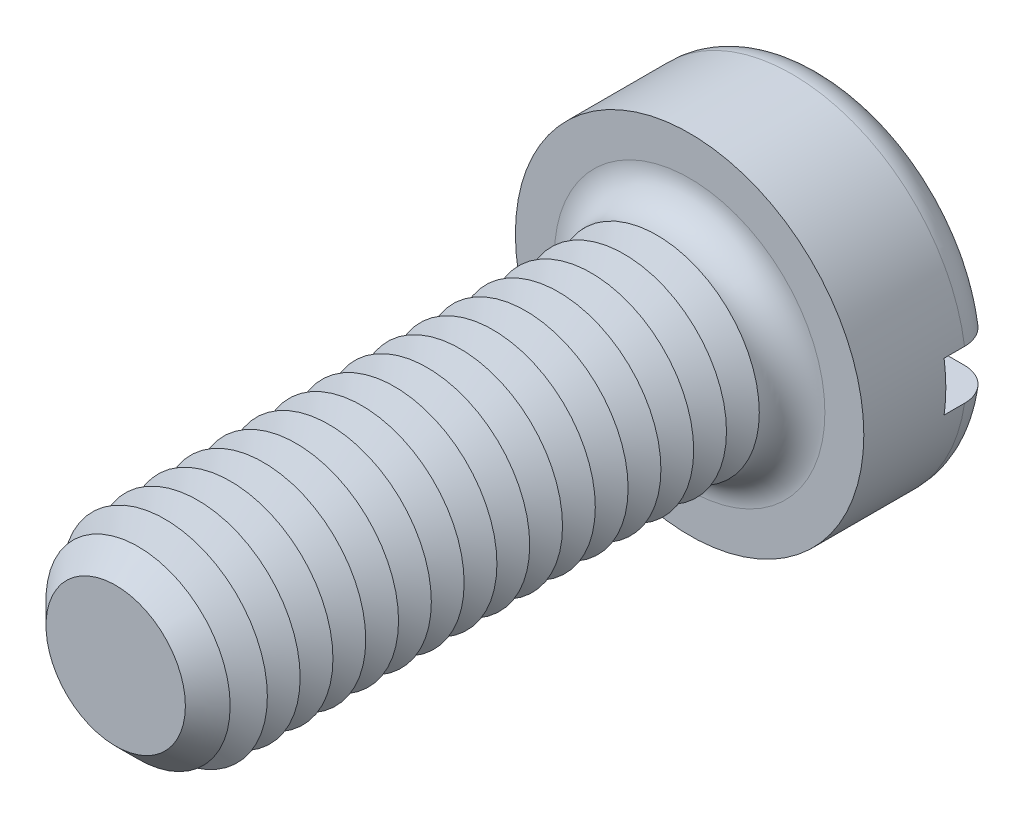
from build123d import *

# Parameters (mm, degrees)
SKETCH3_R           = 4.25
BOSS_EXTRUDE2_DEPTH = 3.3
SKETCH4_R           = 2.5
BOSS_EXTRUDE3_DEPTH = 14
FILLET1_R           = 0.8
CHAMFER1_SIZE       = 0.8
LPATTERN1_COUNT     = 16
LPATTERN1_PITCH     = 0.8
SKETCH8_W           = 8.5
SKETCH8_H           = 1.2
CUT_EXTRUDE1_DEPTH  = 1.3


with BuildPart() as part:
    # Sketch3 → Boss-Extrude2 (new body)
    with BuildSketch(Plane.XY):
        Circle(SKETCH3_R)
    extrude(amount=-BOSS_EXTRUDE2_DEPTH)

    # Sketch4 → Boss-Extrude3 (add)
    with BuildSketch(Plane.XY):
        Circle(SKETCH4_R)
    extrude(amount=BOSS_EXTRUDE3_DEPTH)

    # Fillet1
    fillet1_edges = [part.edges().sort_by_distance(p)[0] for p in [
        (-4.25, 0, -3.3),
        (-2.5, 0, 0),
    ]]
    fillet(fillet1_edges, radius=FILLET1_R)

    # Chamfer1
    chamfer1_edges = [part.edges().sort_by_distance(p)[0] for p in [
        (-2.5, 0, 14),
    ]]
    chamfer(chamfer1_edges, length=CHAMFER1_SIZE)

    # Sketch6 → Cut-Revolve1 (revolve, cut)
    with BuildSketch(Plane(origin=(0, 0, 0), x_dir=(0, 0, -1), z_dir=(1, 0, 0)), mode=Mode.PRIVATE) as cut_revolve1_sk:
        Polygon((-0.8, 2.5), (-1.2, 1.807179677), (-1.6, 2.5), align=None)
    cut_revolve1 = revolve(cut_revolve1_sk.sketch.rotate(Axis((0, 0, -1.694361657), (0, 0, 1)), 90), axis=Axis((0, 0, -1.694361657), (0, 0, 1)), mode=Mode.SUBTRACT)

    # LPattern1: Cut-Revolve1 ×16
    with Locations(*[(0, 0, i * LPATTERN1_PITCH) for i in range(1, LPATTERN1_COUNT)]):
        add(cut_revolve1, mode=Mode.SUBTRACT)

    # Sketch8 → Cut-Extrude1 (cut)
    with BuildSketch(Plane(origin=(0, 0, -3.3), x_dir=(-1, 0, 0), z_dir=(0, 0, -1))):
        Rectangle(SKETCH8_W, SKETCH8_H)
    extrude(amount=-CUT_EXTRUDE1_DEPTH, mode=Mode.SUBTRACT)


solid = part.part
